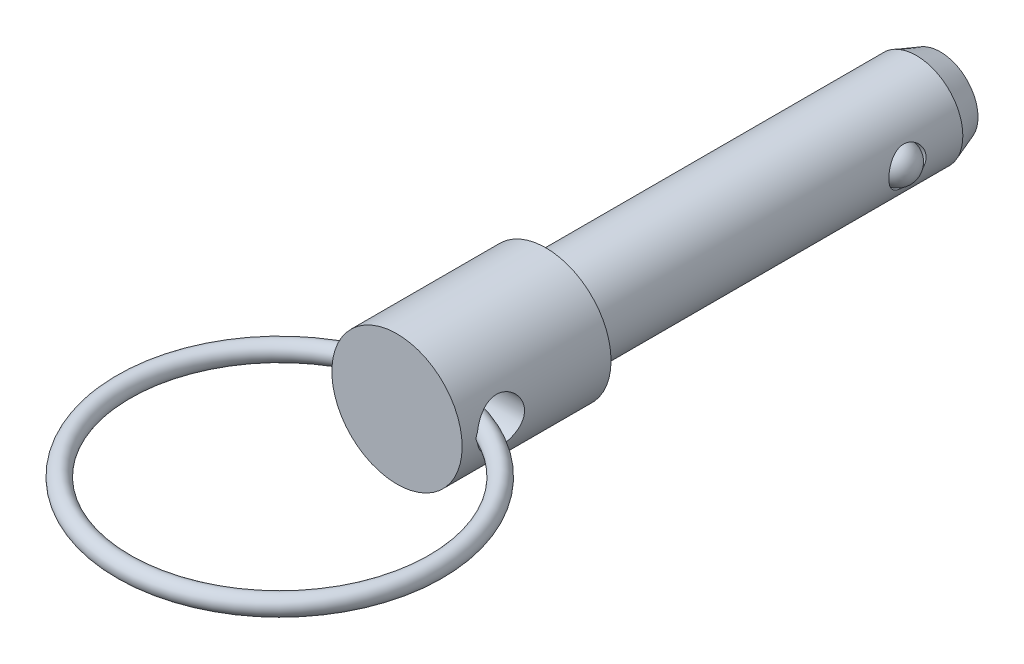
ISO-10303-21;
HEADER;
FILE_DESCRIPTION(('STEP AP214'),'2;1');
FILE_NAME('part.step','',(''),(''),'','','');
FILE_SCHEMA(('AUTOMOTIVE_DESIGN { 1 0 10303 214 1 1 1 1 }'));
ENDSEC;
DATA;
#1=APPLICATION_CONTEXT('core data for automotive mechanical design processes');
#2=APPLICATION_PROTOCOL_DEFINITION('international standard','automotive_design',2000,#1);
#3=PRODUCT_CONTEXT('',#1,'mechanical');
#4=PRODUCT('Part','Part','',(#3));
#5=PRODUCT_RELATED_PRODUCT_CATEGORY('part','',(#4));
#6=PRODUCT_DEFINITION_FORMATION('','',#4);
#7=PRODUCT_DEFINITION_CONTEXT('part definition',#1,'design');
#8=PRODUCT_DEFINITION('design','',#6,#7);
#9=PRODUCT_DEFINITION_SHAPE('','',#8);
#10=(LENGTH_UNIT() NAMED_UNIT(*) SI_UNIT(.MILLI.,.METRE.));
#11=(NAMED_UNIT(*) PLANE_ANGLE_UNIT() SI_UNIT($,.RADIAN.));
#12=(NAMED_UNIT(*) SI_UNIT($,.STERADIAN.) SOLID_ANGLE_UNIT());
#13=UNCERTAINTY_MEASURE_WITH_UNIT(LENGTH_MEASURE(1.E-05),#10,'distance_accuracy_value','');
#14=(GEOMETRIC_REPRESENTATION_CONTEXT(3) GLOBAL_UNCERTAINTY_ASSIGNED_CONTEXT((#13)) GLOBAL_UNIT_ASSIGNED_CONTEXT((#10,
#11,#12)) REPRESENTATION_CONTEXT('',''));
#15=CARTESIAN_POINT('',(0.,0.,0.));
#16=DIRECTION('',(0.,0.,1.));
#17=DIRECTION('',(1.,0.,0.));
#18=AXIS2_PLACEMENT_3D('',#15,#16,#17);
#19=CARTESIAN_POINT('',(7.9375,0.,9.398));
#20=DIRECTION('',(-1.,0.,0.));
#21=DIRECTION('',(0.,0.,-1.));
#22=AXIS2_PLACEMENT_3D('',#19,#20,#21);
#23=CYLINDRICAL_SURFACE('',#22,2.0193);
#24=CARTESIAN_POINT('',(-5.55645,0.413388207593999,11.3745329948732));
#25=CARTESIAN_POINT('',(-5.53323669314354,0.388835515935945,11.3796705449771));
#26=CARTESIAN_POINT('',(-5.51157389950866,0.362641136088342,11.3846690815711));
#27=CARTESIAN_POINT('',(-5.47216390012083,0.307044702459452,11.3940198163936));
#28=CARTESIAN_POINT('',(-5.45444977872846,0.277618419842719,11.3983664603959));
#29=CARTESIAN_POINT('',(-5.42406600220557,0.215851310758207,11.4059720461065));
#30=CARTESIAN_POINT('',(-5.41142802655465,0.183493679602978,11.4092241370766));
#31=CARTESIAN_POINT('',(-5.39235124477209,0.116986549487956,11.4141821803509));
#32=CARTESIAN_POINT('',(-5.38588919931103,0.0828442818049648,11.4158939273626));
#33=CARTESIAN_POINT('',(-5.37995615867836,0.0172985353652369,11.4174656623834));
#34=CARTESIAN_POINT('',(-5.37986165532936,-0.0140451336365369,11.4174908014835));
#35=CARTESIAN_POINT('',(-5.38511249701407,-0.0762532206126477,11.4160995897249));
#36=CARTESIAN_POINT('',(-5.39046041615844,-0.107117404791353,11.4146825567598));
#37=CARTESIAN_POINT('',(-5.40574321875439,-0.165640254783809,11.4106965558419));
#38=CARTESIAN_POINT('',(-5.41539031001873,-0.193380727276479,11.408200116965));
#39=CARTESIAN_POINT('',(-5.43862859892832,-0.247073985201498,11.4023097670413));
#40=CARTESIAN_POINT('',(-5.45222392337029,-0.273024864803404,11.398914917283));
#41=CARTESIAN_POINT('',(-5.48024922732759,-0.318737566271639,11.3920973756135));
#42=CARTESIAN_POINT('',(-5.4941872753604,-0.338820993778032,11.3887682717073));
#43=CARTESIAN_POINT('',(-5.523970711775,-0.37733037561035,11.3818282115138));
#44=CARTESIAN_POINT('',(-5.5398075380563,-0.395763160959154,11.378218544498));
#45=CARTESIAN_POINT('',(-5.55645,-0.413388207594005,11.3745329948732));
#46=B_SPLINE_CURVE_WITH_KNOTS('',3,(#24,#25,#26,#27,#28,#29,#30,#31,#32,#33,#34,#35,#36,#37,#38,
#39,#40,#41,#42,#43,#44,#45),.UNSPECIFIED.,.F.,.F.,(4,2,2,2,2,2,2,2,2,2,4),(0.,
0.102621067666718,0.206072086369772,0.310159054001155,0.413852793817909,0.507376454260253,
0.600944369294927,0.689017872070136,0.777183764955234,0.851068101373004,0.924630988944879),.UNSPECIFIED.);
#47=CARTESIAN_POINT('',(-5.54200209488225,0.397651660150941,11.3777589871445));
#48=VERTEX_POINT('',#47);
#49=CARTESIAN_POINT('',(-5.54200209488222,-0.397651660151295,11.3777589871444));
#50=VERTEX_POINT('',#49);
#51=EDGE_CURVE('E40',#48,#50,#46,.T.);
#52=ORIENTED_EDGE('',*,*,#51,.F.);
#53=CARTESIAN_POINT('',(-5.55625,0.,11.4173));
#54=CARTESIAN_POINT('',(-5.55624527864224,-0.109432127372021,11.4172937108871));
#55=CARTESIAN_POINT('',(-5.55298237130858,-0.218969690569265,11.408361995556));
#56=CARTESIAN_POINT('',(-5.54026368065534,-0.43490217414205,11.372953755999));
#57=CARTESIAN_POINT('',(-5.53079819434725,-0.541291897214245,11.3464497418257));
#58=CARTESIAN_POINT('',(-5.50670156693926,-0.747605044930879,11.2769560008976));
#59=CARTESIAN_POINT('',(-5.49208344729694,-0.84754402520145,11.2340078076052));
#60=CARTESIAN_POINT('',(-5.45915039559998,-1.03875753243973,11.1330083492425));
#61=CARTESIAN_POINT('',(-5.44083572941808,-1.13003268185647,11.0749581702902));
#62=CARTESIAN_POINT('',(-5.4015811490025,-1.30505728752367,10.9429422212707));
#63=CARTESIAN_POINT('',(-5.38056990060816,-1.38841141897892,10.8684736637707));
#64=CARTESIAN_POINT('',(-5.33865236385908,-1.54176439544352,10.7067995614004));
#65=CARTESIAN_POINT('',(-5.31774611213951,-1.61175885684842,10.6195898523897));
#66=CARTESIAN_POINT('',(-5.27759352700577,-1.73882919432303,10.4311528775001));
#67=CARTESIAN_POINT('',(-5.25843183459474,-1.79536185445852,10.3295394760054));
#68=CARTESIAN_POINT('',(-5.22503611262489,-1.89036141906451,10.1174402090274));
#69=CARTESIAN_POINT('',(-5.21080023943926,-1.92883508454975,10.0069576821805));
#70=CARTESIAN_POINT('',(-5.18962447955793,-1.98509166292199,9.78477737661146));
#71=CARTESIAN_POINT('',(-5.18242178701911,-2.00362275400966,9.67329490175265));
#72=CARTESIAN_POINT('',(-5.17535625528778,-2.02180769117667,9.44858805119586));
#73=CARTESIAN_POINT('',(-5.17549061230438,-2.02146874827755,9.33536435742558));
#74=CARTESIAN_POINT('',(-5.18285629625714,-2.00249790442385,9.11709454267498));
#75=CARTESIAN_POINT('',(-5.18969215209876,-1.98488533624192,9.01194405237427));
#76=CARTESIAN_POINT('',(-5.20903632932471,-1.93354575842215,8.80620743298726));
#77=CARTESIAN_POINT('',(-5.22154547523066,-1.89981640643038,8.70562196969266));
#78=CARTESIAN_POINT('',(-5.25107746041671,-1.81661001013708,8.50972358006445));
#79=CARTESIAN_POINT('',(-5.26817827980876,-1.76685762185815,8.41453987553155));
#80=CARTESIAN_POINT('',(-5.30493780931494,-1.65321144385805,8.23357336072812));
#81=CARTESIAN_POINT('',(-5.32459724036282,-1.58931366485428,8.14779321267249));
#82=CARTESIAN_POINT('',(-5.36576425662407,-1.44447059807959,7.98240722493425));
#83=CARTESIAN_POINT('',(-5.3873104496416,-1.36270785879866,7.90352531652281));
#84=CARTESIAN_POINT('',(-5.42876622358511,-1.18682967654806,7.76035905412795));
#85=CARTESIAN_POINT('',(-5.44867505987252,-1.09270866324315,7.69608131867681));
#86=CARTESIAN_POINT('',(-5.48497084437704,-0.893001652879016,7.58320896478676));
#87=CARTESIAN_POINT('',(-5.50130295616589,-0.787270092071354,7.53485348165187));
#88=CARTESIAN_POINT('',(-5.52817729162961,-0.568540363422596,7.45692936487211));
#89=CARTESIAN_POINT('',(-5.53873126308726,-0.455557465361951,7.42732259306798));
#90=CARTESIAN_POINT('',(-5.54924569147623,-0.284581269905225,7.39803699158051));
#91=CARTESIAN_POINT('',(-5.5518636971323,-0.227949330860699,7.39079572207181));
#92=CARTESIAN_POINT('',(-5.55536708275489,-0.114221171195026,7.38112558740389));
#93=CARTESIAN_POINT('',(-5.55625246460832,-0.0571249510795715,7.37869671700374));
#94=CARTESIAN_POINT('',(-5.55624527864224,0.109432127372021,7.37870628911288));
#95=CARTESIAN_POINT('',(-5.55298237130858,0.218969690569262,7.38763800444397));
#96=CARTESIAN_POINT('',(-5.54026368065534,0.434902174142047,7.42304624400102));
#97=CARTESIAN_POINT('',(-5.53079819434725,0.541291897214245,7.44955025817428));
#98=CARTESIAN_POINT('',(-5.50670156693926,0.74760504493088,7.51904399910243));
#99=CARTESIAN_POINT('',(-5.49208344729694,0.847544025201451,7.56199219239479));
#100=CARTESIAN_POINT('',(-5.45915039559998,1.03875753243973,7.66299165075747));
#101=CARTESIAN_POINT('',(-5.44083572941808,1.13003268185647,7.72104182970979));
#102=CARTESIAN_POINT('',(-5.4015811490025,1.30505728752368,7.85305777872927));
#103=CARTESIAN_POINT('',(-5.38056990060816,1.38841141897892,7.92752633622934));
#104=CARTESIAN_POINT('',(-5.33865236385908,1.54176439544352,8.08920043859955));
#105=CARTESIAN_POINT('',(-5.31774611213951,1.61175885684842,8.17641014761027));
#106=CARTESIAN_POINT('',(-5.27759352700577,1.73882919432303,8.36484712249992));
#107=CARTESIAN_POINT('',(-5.25843183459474,1.79536185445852,8.4664605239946));
#108=CARTESIAN_POINT('',(-5.22503611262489,1.89036141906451,8.6785597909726));
#109=CARTESIAN_POINT('',(-5.21080023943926,1.92883508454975,8.7890423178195));
#110=CARTESIAN_POINT('',(-5.18962447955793,1.985091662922,9.01122262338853));
#111=CARTESIAN_POINT('',(-5.18242178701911,2.00362275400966,9.12270509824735));
#112=CARTESIAN_POINT('',(-5.17535625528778,2.02180769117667,9.34741194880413));
#113=CARTESIAN_POINT('',(-5.17549061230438,2.02146874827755,9.46063564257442));
#114=CARTESIAN_POINT('',(-5.18285629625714,2.00249790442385,9.67890545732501));
#115=CARTESIAN_POINT('',(-5.18969215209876,1.98488533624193,9.78405594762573));
#116=CARTESIAN_POINT('',(-5.20903632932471,1.93354575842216,9.98979256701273));
#117=CARTESIAN_POINT('',(-5.22154547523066,1.89981640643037,10.0903780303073));
#118=CARTESIAN_POINT('',(-5.25107746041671,1.81661001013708,10.2862764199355));
#119=CARTESIAN_POINT('',(-5.26817827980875,1.76685762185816,10.3814601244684));
#120=CARTESIAN_POINT('',(-5.30493780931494,1.65321144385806,10.5624266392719));
#121=CARTESIAN_POINT('',(-5.32459724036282,1.58931366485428,10.6482067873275));
#122=CARTESIAN_POINT('',(-5.36576425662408,1.44447059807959,10.8135927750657));
#123=CARTESIAN_POINT('',(-5.3873104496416,1.36270785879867,10.8924746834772));
#124=CARTESIAN_POINT('',(-5.42876622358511,1.18682967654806,11.0356409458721));
#125=CARTESIAN_POINT('',(-5.44867505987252,1.09270866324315,11.0999186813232));
#126=CARTESIAN_POINT('',(-5.48497084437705,0.893001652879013,11.2127910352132));
#127=CARTESIAN_POINT('',(-5.5013029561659,0.787270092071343,11.2611465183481));
#128=CARTESIAN_POINT('',(-5.52817729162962,0.568540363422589,11.3390706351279));
#129=CARTESIAN_POINT('',(-5.53873126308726,0.455557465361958,11.3686774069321));
#130=CARTESIAN_POINT('',(-5.54924569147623,0.28458126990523,11.3979630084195));
#131=CARTESIAN_POINT('',(-5.5518636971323,0.2279493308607,11.4052042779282));
#132=CARTESIAN_POINT('',(-5.55536708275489,0.114221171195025,11.4148744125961));
#133=CARTESIAN_POINT('',(-5.55625246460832,0.0571249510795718,11.4173032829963));
#134=CARTESIAN_POINT('',(-5.55625,0.,11.4173));
#135=B_SPLINE_CURVE_WITH_KNOTS('',3,(#53,#54,#55,#56,#57,#58,#59,#60,#61,#62,#63,#64,#65,#66,
#67,#68,#69,#70,#71,#72,#73,#74,#75,#76,#77,#78,#79,#80,#81,#82,#83,#84,#85,#86,#87,#88,#89,#90,
#91,#92,#93,#94,#95,#96,#97,#98,#99,#100,#101,#102,#103,#104,#105,#106,#107,#108,#109,#110,#111,
#112,#113,#114,#115,#116,#117,#118,#119,#120,#121,#122,#123,#124,#125,#126,#127,#128,#129,#130,
#131,#132,#133,#134),.UNSPECIFIED.,.T.,.F.,(4,2,2,2,2,2,2,2,2,2,2,2,2,2,2,2,2,2,2,2,2,2,2,2,2,2,
2,2,2,2,2,2,2,2,2,2,2,2,2,2,4),(0.,0.328075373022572,0.65666519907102,0.984430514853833,
1.31217226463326,1.65185430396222,1.99164760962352,2.34343505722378,2.69509069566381,
3.03303658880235,3.37085333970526,3.68986542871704,4.00892389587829,4.33378721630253,
4.65874227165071,5.00406386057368,5.34954163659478,5.6999936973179,6.04973056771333,
6.22099023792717,6.39224972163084,6.72032509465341,7.04891492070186,7.37668023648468,
7.70442198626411,8.04410402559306,8.38389733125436,8.73568477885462,9.08734041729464,
9.42528631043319,9.7631030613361,10.0821151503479,10.4011736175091,10.7260369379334,
11.0509919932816,11.3963135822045,11.7417913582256,12.0922434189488,12.4419802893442,
12.613239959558,12.7844994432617),.UNSPECIFIED.);
#136=EDGE_CURVE('E66',#50,#48,#135,.T.);
#137=ORIENTED_EDGE('',*,*,#136,.F.);
#138=EDGE_LOOP('',(#52,#137));
#139=FACE_BOUND('',#138,.T.);
#140=CARTESIAN_POINT('',(5.55645,-0.413388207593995,11.3745329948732));
#141=CARTESIAN_POINT('',(5.53323669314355,-0.388835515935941,11.3796705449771));
#142=CARTESIAN_POINT('',(5.51157389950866,-0.362641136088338,11.3846690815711));
#143=CARTESIAN_POINT('',(5.47216390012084,-0.307044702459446,11.3940198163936));
#144=CARTESIAN_POINT('',(5.45444977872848,-0.277618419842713,11.3983664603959));
#145=CARTESIAN_POINT('',(5.42406600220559,-0.215851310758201,11.4059720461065));
#146=CARTESIAN_POINT('',(5.41142802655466,-0.183493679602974,11.4092241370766));
#147=CARTESIAN_POINT('',(5.3923512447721,-0.116986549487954,11.4141821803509));
#148=CARTESIAN_POINT('',(5.38588919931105,-0.0828442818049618,11.4158939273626));
#149=CARTESIAN_POINT('',(5.37995615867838,-0.0172985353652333,11.4174656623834));
#150=CARTESIAN_POINT('',(5.37986165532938,0.0140451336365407,11.4174908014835));
#151=CARTESIAN_POINT('',(5.38511249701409,0.0762532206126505,11.4160995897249));
#152=CARTESIAN_POINT('',(5.39046041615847,0.107117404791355,11.4146825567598));
#153=CARTESIAN_POINT('',(5.40574321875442,0.165640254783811,11.4106965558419));
#154=CARTESIAN_POINT('',(5.41539031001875,0.193380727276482,11.408200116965));
#155=CARTESIAN_POINT('',(5.43862859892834,0.247073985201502,11.4023097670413));
#156=CARTESIAN_POINT('',(5.45222392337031,0.273024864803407,11.398914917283));
#157=CARTESIAN_POINT('',(5.48024922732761,0.318737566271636,11.3920973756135));
#158=CARTESIAN_POINT('',(5.49418727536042,0.338820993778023,11.3887682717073));
#159=CARTESIAN_POINT('',(5.52397071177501,0.377330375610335,11.3818282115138));
#160=CARTESIAN_POINT('',(5.5398075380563,0.395763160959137,11.378218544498));
#161=CARTESIAN_POINT('',(5.55645,0.413388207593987,11.3745329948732));
#162=B_SPLINE_CURVE_WITH_KNOTS('',3,(#140,#141,#142,#143,#144,#145,#146,#147,#148,#149,#150,
#151,#152,#153,#154,#155,#156,#157,#158,#159,#160,#161),.UNSPECIFIED.,.F.,.F.,(4,2,2,2,2,2,2,2,
2,2,4),(0.,0.10262106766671,0.206072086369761,0.310159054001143,0.413852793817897,
0.507376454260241,0.600944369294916,0.689017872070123,0.777183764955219,0.851068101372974,
0.924630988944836),.UNSPECIFIED.);
#163=CARTESIAN_POINT('',(5.54200209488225,-0.397651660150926,11.3777589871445));
#164=VERTEX_POINT('',#163);
#165=CARTESIAN_POINT('',(5.54200209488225,0.397651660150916,11.3777589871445));
#166=VERTEX_POINT('',#165);
#167=EDGE_CURVE('E33',#164,#166,#162,.T.);
#168=ORIENTED_EDGE('',*,*,#167,.F.);
#169=CARTESIAN_POINT('',(5.55625,0.,7.3787));
#170=CARTESIAN_POINT('',(5.55624527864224,-0.109432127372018,7.37870628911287));
#171=CARTESIAN_POINT('',(5.55298237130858,-0.21896969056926,7.38763800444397));
#172=CARTESIAN_POINT('',(5.54026368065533,-0.434902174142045,7.42304624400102));
#173=CARTESIAN_POINT('',(5.53079819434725,-0.541291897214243,7.44955025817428));
#174=CARTESIAN_POINT('',(5.50670156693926,-0.747605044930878,7.51904399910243));
#175=CARTESIAN_POINT('',(5.49208344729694,-0.847544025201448,7.56199219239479));
#176=CARTESIAN_POINT('',(5.45915039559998,-1.03875753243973,7.66299165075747));
#177=CARTESIAN_POINT('',(5.44083572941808,-1.13003268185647,7.72104182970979));
#178=CARTESIAN_POINT('',(5.4015811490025,-1.30505728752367,7.85305777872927));
#179=CARTESIAN_POINT('',(5.38056990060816,-1.38841141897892,7.92752633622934));
#180=CARTESIAN_POINT('',(5.33865236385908,-1.54176439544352,8.08920043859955));
#181=CARTESIAN_POINT('',(5.31774611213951,-1.61175885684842,8.17641014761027));
#182=CARTESIAN_POINT('',(5.27759352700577,-1.73882919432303,8.36484712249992));
#183=CARTESIAN_POINT('',(5.25843183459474,-1.79536185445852,8.4664605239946));
#184=CARTESIAN_POINT('',(5.22503611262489,-1.89036141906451,8.6785597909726));
#185=CARTESIAN_POINT('',(5.21080023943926,-1.92883508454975,8.7890423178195));
#186=CARTESIAN_POINT('',(5.18962447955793,-1.98509166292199,9.01122262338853));
#187=CARTESIAN_POINT('',(5.18242178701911,-2.00362275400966,9.12270509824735));
#188=CARTESIAN_POINT('',(5.17535625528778,-2.02180769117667,9.34741194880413));
#189=CARTESIAN_POINT('',(5.17549061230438,-2.02146874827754,9.46063564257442));
#190=CARTESIAN_POINT('',(5.18285629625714,-2.00249790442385,9.67890545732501));
#191=CARTESIAN_POINT('',(5.18969215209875,-1.98488533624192,9.78405594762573));
#192=CARTESIAN_POINT('',(5.20903632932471,-1.93354575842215,9.98979256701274));
#193=CARTESIAN_POINT('',(5.22154547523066,-1.89981640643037,10.0903780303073));
#194=CARTESIAN_POINT('',(5.25107746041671,-1.81661001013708,10.2862764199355));
#195=CARTESIAN_POINT('',(5.26817827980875,-1.76685762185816,10.3814601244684));
#196=CARTESIAN_POINT('',(5.30493780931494,-1.65321144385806,10.5624266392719));
#197=CARTESIAN_POINT('',(5.32459724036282,-1.58931366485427,10.6482067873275));
#198=CARTESIAN_POINT('',(5.36576425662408,-1.44447059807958,10.8135927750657));
#199=CARTESIAN_POINT('',(5.3873104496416,-1.36270785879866,10.8924746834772));
#200=CARTESIAN_POINT('',(5.42876622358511,-1.18682967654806,11.0356409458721));
#201=CARTESIAN_POINT('',(5.44867505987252,-1.09270866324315,11.0999186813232));
#202=CARTESIAN_POINT('',(5.48497084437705,-0.893001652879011,11.2127910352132));
#203=CARTESIAN_POINT('',(5.50130295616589,-0.78727009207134,11.2611465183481));
#204=CARTESIAN_POINT('',(5.52817729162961,-0.568540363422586,11.3390706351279));
#205=CARTESIAN_POINT('',(5.53873126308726,-0.455557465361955,11.3686774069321));
#206=CARTESIAN_POINT('',(5.54924569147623,-0.284581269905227,11.3979630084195));
#207=CARTESIAN_POINT('',(5.5518636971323,-0.227949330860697,11.4052042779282));
#208=CARTESIAN_POINT('',(5.55536708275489,-0.114221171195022,11.4148744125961));
#209=CARTESIAN_POINT('',(5.55625246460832,-0.0571249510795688,11.4173032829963));
#210=CARTESIAN_POINT('',(5.55624527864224,0.109432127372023,11.4172937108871));
#211=CARTESIAN_POINT('',(5.55298237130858,0.218969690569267,11.408361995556));
#212=CARTESIAN_POINT('',(5.54026368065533,0.434902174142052,11.372953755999));
#213=CARTESIAN_POINT('',(5.53079819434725,0.541291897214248,11.3464497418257));
#214=CARTESIAN_POINT('',(5.50670156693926,0.747605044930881,11.2769560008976));
#215=CARTESIAN_POINT('',(5.49208344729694,0.847544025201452,11.2340078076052));
#216=CARTESIAN_POINT('',(5.45915039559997,1.03875753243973,11.1330083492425));
#217=CARTESIAN_POINT('',(5.44083572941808,1.13003268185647,11.0749581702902));
#218=CARTESIAN_POINT('',(5.4015811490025,1.30505728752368,10.9429422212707));
#219=CARTESIAN_POINT('',(5.38056990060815,1.38841141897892,10.8684736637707));
#220=CARTESIAN_POINT('',(5.33865236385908,1.54176439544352,10.7067995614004));
#221=CARTESIAN_POINT('',(5.31774611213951,1.61175885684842,10.6195898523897));
#222=CARTESIAN_POINT('',(5.27759352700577,1.73882919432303,10.4311528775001));
#223=CARTESIAN_POINT('',(5.25843183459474,1.79536185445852,10.3295394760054));
#224=CARTESIAN_POINT('',(5.22503611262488,1.89036141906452,10.1174402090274));
#225=CARTESIAN_POINT('',(5.21080023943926,1.92883508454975,10.0069576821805));
#226=CARTESIAN_POINT('',(5.18962447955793,1.985091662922,9.78477737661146));
#227=CARTESIAN_POINT('',(5.18242178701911,2.00362275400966,9.67329490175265));
#228=CARTESIAN_POINT('',(5.17535625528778,2.02180769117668,9.44858805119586));
#229=CARTESIAN_POINT('',(5.17549061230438,2.02146874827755,9.33536435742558));
#230=CARTESIAN_POINT('',(5.18285629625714,2.00249790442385,9.11709454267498));
#231=CARTESIAN_POINT('',(5.18969215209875,1.98488533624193,9.01194405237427));
#232=CARTESIAN_POINT('',(5.20903632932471,1.93354575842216,8.80620743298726));
#233=CARTESIAN_POINT('',(5.22154547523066,1.89981640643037,8.70562196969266));
#234=CARTESIAN_POINT('',(5.25107746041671,1.81661001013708,8.50972358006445));
#235=CARTESIAN_POINT('',(5.26817827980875,1.76685762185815,8.41453987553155));
#236=CARTESIAN_POINT('',(5.30493780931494,1.65321144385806,8.23357336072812));
#237=CARTESIAN_POINT('',(5.32459724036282,1.58931366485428,8.14779321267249));
#238=CARTESIAN_POINT('',(5.36576425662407,1.44447059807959,7.98240722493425));
#239=CARTESIAN_POINT('',(5.3873104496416,1.36270785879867,7.90352531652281));
#240=CARTESIAN_POINT('',(5.42876622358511,1.18682967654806,7.76035905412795));
#241=CARTESIAN_POINT('',(5.44867505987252,1.09270866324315,7.69608131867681));
#242=CARTESIAN_POINT('',(5.48497084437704,0.893001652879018,7.58320896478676));
#243=CARTESIAN_POINT('',(5.50130295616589,0.787270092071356,7.53485348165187));
#244=CARTESIAN_POINT('',(5.52817729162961,0.568540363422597,7.45692936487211));
#245=CARTESIAN_POINT('',(5.53873126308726,0.455557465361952,7.42732259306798));
#246=CARTESIAN_POINT('',(5.54924569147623,0.284581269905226,7.39803699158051));
#247=CARTESIAN_POINT('',(5.5518636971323,0.2279493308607,7.39079572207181));
#248=CARTESIAN_POINT('',(5.55536708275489,0.114221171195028,7.38112558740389));
#249=CARTESIAN_POINT('',(5.55625246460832,0.0571249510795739,7.37869671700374));
#250=CARTESIAN_POINT('',(5.55625,0.,7.3787));
#251=B_SPLINE_CURVE_WITH_KNOTS('',3,(#169,#170,#171,#172,#173,#174,#175,#176,#177,#178,#179,
#180,#181,#182,#183,#184,#185,#186,#187,#188,#189,#190,#191,#192,#193,#194,#195,#196,#197,#198,
#199,#200,#201,#202,#203,#204,#205,#206,#207,#208,#209,#210,#211,#212,#213,#214,#215,#216,#217,
#218,#219,#220,#221,#222,#223,#224,#225,#226,#227,#228,#229,#230,#231,#232,#233,#234,#235,#236,
#237,#238,#239,#240,#241,#242,#243,#244,#245,#246,#247,#248,#249,#250),.UNSPECIFIED.,.T.,.F.,(4,
2,2,2,2,2,2,2,2,2,2,2,2,2,2,2,2,2,2,2,2,2,2,2,2,2,2,2,2,2,2,2,2,2,2,2,2,2,2,2,4),(0.,
0.328075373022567,0.656665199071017,0.984430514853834,1.31217226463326,1.65185430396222,
1.99164760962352,2.34343505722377,2.6950906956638,3.03303658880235,3.37085333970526,
3.68986542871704,4.00892389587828,4.33378721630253,4.65874227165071,5.00406386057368,
5.34954163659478,5.69999369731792,6.04973056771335,6.22099023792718,6.39224972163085,
6.72032509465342,7.04891492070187,7.37668023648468,7.70442198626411,8.04410402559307,
8.38389733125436,8.73568477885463,9.08734041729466,9.4252863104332,9.76310306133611,
10.0821151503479,10.4011736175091,10.7260369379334,11.0509919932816,11.3963135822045,
11.7417913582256,12.0922434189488,12.4419802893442,12.613239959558,12.7844994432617),.UNSPECIFIED.);
#252=EDGE_CURVE('E62',#166,#164,#251,.T.);
#253=ORIENTED_EDGE('',*,*,#252,.F.);
#254=EDGE_LOOP('',(#168,#253));
#255=FACE_BOUND('',#254,.T.);
#256=ADVANCED_FACE('F14',(#139,#255),#23,.F.);
#257=CARTESIAN_POINT('',(0.,0.,-28.63596));
#258=DIRECTION('',(0.,0.,-1.));
#259=DIRECTION('',(1.,0.,0.));
#260=AXIS2_PLACEMENT_3D('',#257,#258,#259);
#261=CYLINDRICAL_SURFACE('',#260,5.55625);
#262=ORIENTED_EDGE('',*,*,#252,.T.);
#263=CARTESIAN_POINT('',(5.55009347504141,-0.261488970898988,9.78608403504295));
#264=CARTESIAN_POINT('',(5.54812529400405,-0.303251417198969,9.80096224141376));
#265=CARTESIAN_POINT('',(5.5457404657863,-0.343758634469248,9.81942005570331));
#266=CARTESIAN_POINT('',(5.54040847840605,-0.421066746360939,9.86292845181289));
#267=CARTESIAN_POINT('',(5.5374605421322,-0.45786241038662,9.88798816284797));
#268=CARTESIAN_POINT('',(5.53134134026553,-0.526658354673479,9.94386457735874));
#269=CARTESIAN_POINT('',(5.52817046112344,-0.558666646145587,9.97467146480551));
#270=CARTESIAN_POINT('',(5.52194469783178,-0.617178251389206,10.0411137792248));
#271=CARTESIAN_POINT('',(5.51888978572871,-0.643682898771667,10.0767480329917));
#272=CARTESIAN_POINT('',(5.51313628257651,-0.691254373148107,10.1527268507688));
#273=CARTESIAN_POINT('',(5.51044827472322,-0.712171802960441,10.1931655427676));
#274=CARTESIAN_POINT('',(5.50578097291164,-0.747399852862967,10.2768577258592));
#275=CARTESIAN_POINT('',(5.50380188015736,-0.761708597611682,10.3201120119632));
#276=CARTESIAN_POINT('',(5.50062483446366,-0.784334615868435,10.4110491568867));
#277=CARTESIAN_POINT('',(5.4994831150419,-0.792223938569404,10.4588401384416));
#278=CARTESIAN_POINT('',(5.49826873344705,-0.800607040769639,10.5550754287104));
#279=CARTESIAN_POINT('',(5.49819646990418,-0.801098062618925,10.6035199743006));
#280=CARTESIAN_POINT('',(5.49912806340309,-0.79468062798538,10.7039443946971));
#281=CARTESIAN_POINT('',(5.50022168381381,-0.787154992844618,10.7558841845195));
#282=CARTESIAN_POINT('',(5.50347103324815,-0.764103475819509,10.8579332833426));
#283=CARTESIAN_POINT('',(5.5056272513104,-0.748573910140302,10.9080417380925));
#284=CARTESIAN_POINT('',(5.51091051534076,-0.708667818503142,11.0082212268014));
#285=CARTESIAN_POINT('',(5.51408971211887,-0.683800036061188,11.0580951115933));
#286=CARTESIAN_POINT('',(5.5209680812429,-0.625839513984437,11.1528267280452));
#287=CARTESIAN_POINT('',(5.52466742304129,-0.59274409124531,11.197682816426));
#288=CARTESIAN_POINT('',(5.53199718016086,-0.519831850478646,11.2794067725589));
#289=CARTESIAN_POINT('',(5.53562669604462,-0.480224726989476,11.3164602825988));
#290=CARTESIAN_POINT('',(5.54239660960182,-0.39445002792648,11.3820559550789));
#291=CARTESIAN_POINT('',(5.54553772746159,-0.348292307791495,11.4106107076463));
#292=CARTESIAN_POINT('',(5.55042537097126,-0.257766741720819,11.4537693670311));
#293=CARTESIAN_POINT('',(5.55230678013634,-0.214079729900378,11.4697807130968));
#294=CARTESIAN_POINT('',(5.55503790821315,-0.124373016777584,11.4927832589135));
#295=CARTESIAN_POINT('',(5.55588906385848,-0.0783566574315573,11.4997870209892));
#296=CARTESIAN_POINT('',(5.55638432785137,0.0070585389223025,11.5038718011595));
#297=CARTESIAN_POINT('',(5.55619261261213,0.0463971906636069,11.5023023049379));
#298=CARTESIAN_POINT('',(5.55499790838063,0.124194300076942,11.4923961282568));
#299=CARTESIAN_POINT('',(5.55399500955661,0.162652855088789,11.484060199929));
#300=CARTESIAN_POINT('',(5.55133569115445,0.236455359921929,11.4614747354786));
#301=CARTESIAN_POINT('',(5.54970019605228,0.271858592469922,11.4474138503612));
#302=CARTESIAN_POINT('',(5.54593788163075,0.340082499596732,11.414086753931));
#303=CARTESIAN_POINT('',(5.54381093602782,0.372902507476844,11.394819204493));
#304=CARTESIAN_POINT('',(5.53902830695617,0.438479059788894,11.3497412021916));
#305=CARTESIAN_POINT('',(5.53634134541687,0.470920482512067,11.3234773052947));
#306=CARTESIAN_POINT('',(5.5308403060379,0.531649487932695,11.2665410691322));
#307=CARTESIAN_POINT('',(5.52802616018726,0.559934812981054,11.2358663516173));
#308=CARTESIAN_POINT('',(5.52207389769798,0.616058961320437,11.1660010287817));
#309=CARTESIAN_POINT('',(5.51895184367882,0.643171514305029,11.1262251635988));
#310=CARTESIAN_POINT('',(5.5131400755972,0.691221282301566,11.0430715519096));
#311=CARTESIAN_POINT('',(5.51045062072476,0.712154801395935,10.9996916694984));
#312=CARTESIAN_POINT('',(5.50546631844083,0.749774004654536,10.9047684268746));
#313=CARTESIAN_POINT('',(5.5032620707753,0.765608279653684,10.8528805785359));
#314=CARTESIAN_POINT('',(5.49999925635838,0.788707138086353,10.7471802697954));
#315=CARTESIAN_POINT('',(5.49894104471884,0.795969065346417,10.693367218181));
#316=CARTESIAN_POINT('',(5.49812737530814,0.801573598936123,10.5836973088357));
#317=CARTESIAN_POINT('',(5.49841008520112,0.799654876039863,10.5278260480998));
#318=CARTESIAN_POINT('',(5.50039129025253,0.785912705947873,10.4173293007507));
#319=CARTESIAN_POINT('',(5.50208922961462,0.774093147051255,10.3627033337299));
#320=CARTESIAN_POINT('',(5.50657222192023,0.741502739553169,10.2600057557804));
#321=CARTESIAN_POINT('',(5.50928213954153,0.72134199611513,10.2117380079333));
#322=CARTESIAN_POINT('',(5.51545799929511,0.672487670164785,10.1197820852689));
#323=CARTESIAN_POINT('',(5.51892350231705,0.643799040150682,10.0760912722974));
#324=CARTESIAN_POINT('',(5.52582601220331,0.581424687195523,9.99852087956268));
#325=CARTESIAN_POINT('',(5.52923968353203,0.548383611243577,9.96412004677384));
#326=CARTESIAN_POINT('',(5.53588272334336,0.476663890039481,9.90178589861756));
#327=CARTESIAN_POINT('',(5.53911216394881,0.437987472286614,9.87385003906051));
#328=CARTESIAN_POINT('',(5.54480401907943,0.35854502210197,9.82683552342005));
#329=CARTESIAN_POINT('',(5.54729992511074,0.318028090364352,9.80733901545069));
#330=CARTESIAN_POINT('',(5.55147034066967,0.234199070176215,9.7755782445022));
#331=CARTESIAN_POINT('',(5.55314476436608,0.190886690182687,9.76331473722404));
#332=CARTESIAN_POINT('',(5.55544526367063,0.103875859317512,9.74662090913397));
#333=CARTESIAN_POINT('',(5.55609634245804,0.0602137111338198,9.74200361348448));
#334=CARTESIAN_POINT('',(5.55635470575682,-0.0272293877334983,9.7401597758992));
#335=CARTESIAN_POINT('',(5.55596342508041,-0.0710100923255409,9.74292307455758));
#336=CARTESIAN_POINT('',(5.55456091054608,-0.139289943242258,9.75303365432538));
#337=CARTESIAN_POINT('',(5.55387840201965,-0.164176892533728,9.75797314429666));
#338=CARTESIAN_POINT('',(5.55220711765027,-0.213342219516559,9.77024669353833));
#339=CARTESIAN_POINT('',(5.55121834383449,-0.237620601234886,9.77758073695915));
#340=CARTESIAN_POINT('',(5.55009347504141,-0.261488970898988,9.78608403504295));
#341=B_SPLINE_CURVE_WITH_KNOTS('',3,(#263,#264,#265,#266,#267,#268,#269,#270,#271,#272,#273,
#274,#275,#276,#277,#278,#279,#280,#281,#282,#283,#284,#285,#286,#287,#288,#289,#290,#291,#292,
#293,#294,#295,#296,#297,#298,#299,#300,#301,#302,#303,#304,#305,#306,#307,#308,#309,#310,#311,
#312,#313,#314,#315,#316,#317,#318,#319,#320,#321,#322,#323,#324,#325,#326,#327,#328,#329,#330,
#331,#332,#333,#334,#335,#336,#337,#338,#339,#340),.UNSPECIFIED.,.T.,.F.,(4,2,2,2,2,2,2,2,2,2,2,
2,2,2,2,2,2,2,2,2,2,2,2,2,2,2,2,2,2,2,2,2,2,2,2,2,2,2,4),(0.,0.133035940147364,
0.266256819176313,0.399252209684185,0.532215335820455,0.668441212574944,0.804705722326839,
0.949444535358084,1.09423729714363,1.25104087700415,1.40791668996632,1.57457416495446,
1.74128605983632,1.9034167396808,2.06530602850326,2.20414603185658,2.34279219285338,
2.46030997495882,2.57781469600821,2.69172579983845,2.80566620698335,2.93066170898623,
3.05572486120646,3.19986521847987,3.34409161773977,3.50624490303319,3.66844841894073,
3.83529611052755,4.00207830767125,4.15836501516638,4.31456113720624,4.45728171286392,
4.59994602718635,4.73438372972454,4.86883547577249,4.99994808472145,5.13088030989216,
5.20691445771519,5.28294810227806),.UNSPECIFIED.);
#342=EDGE_CURVE('E27',#164,#166,#341,.T.);
#343=ORIENTED_EDGE('',*,*,#342,.T.);
#344=EDGE_LOOP('',(#262,#343));
#345=FACE_BOUND('',#344,.T.);
#346=CARTESIAN_POINT('',(0.,0.,-8.27046764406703E-11));
#347=DIRECTION('',(0.,0.,-1.));
#348=DIRECTION('',(1.,0.,0.));
#349=AXIS2_PLACEMENT_3D('',#346,#347,#348);
#350=CIRCLE('',#349,5.55625000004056);
#351=CARTESIAN_POINT('',(5.55625000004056,0.,-8.2704921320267E-11));
#352=VERTEX_POINT('',#351);
#353=EDGE_CURVE('E71',#352,#352,#350,.T.);
#354=ORIENTED_EDGE('',*,*,#353,.F.);
#355=EDGE_LOOP('',(#354));
#356=FACE_BOUND('',#355,.T.);
#357=CARTESIAN_POINT('',(0.,0.,12.7000000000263));
#358=DIRECTION('',(0.,0.,-1.));
#359=DIRECTION('',(1.,0.,0.));
#360=AXIS2_PLACEMENT_3D('',#357,#358,#359);
#361=CIRCLE('',#360,5.55625000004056);
#362=CARTESIAN_POINT('',(5.55625000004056,0.,12.7000000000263));
#363=VERTEX_POINT('',#362);
#364=EDGE_CURVE('E279',#363,#363,#361,.T.);
#365=ORIENTED_EDGE('',*,*,#364,.T.);
#366=EDGE_LOOP('',(#365));
#367=FACE_BOUND('',#366,.T.);
#368=ORIENTED_EDGE('',*,*,#136,.T.);
#369=CARTESIAN_POINT('',(-5.55009347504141,-0.261488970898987,9.78608403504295));
#370=CARTESIAN_POINT('',(-5.55201952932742,-0.220600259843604,9.77152029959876));
#371=CARTESIAN_POINT('',(-5.55354800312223,-0.17846445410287,9.76037150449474));
#372=CARTESIAN_POINT('',(-5.5556384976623,-0.0928868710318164,9.74524129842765));
#373=CARTESIAN_POINT('',(-5.55620009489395,-0.0494445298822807,9.7412630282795));
#374=CARTESIAN_POINT('',(-5.55629347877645,0.0374935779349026,9.74059719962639));
#375=CARTESIAN_POINT('',(-5.55582538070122,0.080989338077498,9.74390882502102));
#376=CARTESIAN_POINT('',(-5.55391173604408,0.16679574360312,9.75772411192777));
#377=CARTESIAN_POINT('',(-5.5524662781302,0.209106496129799,9.76822712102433));
#378=CARTESIAN_POINT('',(-5.54875885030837,0.291350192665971,9.79611251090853));
#379=CARTESIAN_POINT('',(-5.54649699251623,0.331283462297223,9.81349394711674));
#380=CARTESIAN_POINT('',(-5.54140563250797,0.407683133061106,9.8546186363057));
#381=CARTESIAN_POINT('',(-5.53857612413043,0.444149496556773,9.87836195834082));
#382=CARTESIAN_POINT('',(-5.53262152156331,0.513054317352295,9.93180289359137));
#383=CARTESIAN_POINT('',(-5.52949345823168,0.545442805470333,9.96156453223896));
#384=CARTESIAN_POINT('',(-5.52330278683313,0.60492731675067,10.0259730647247));
#385=CARTESIAN_POINT('',(-5.52024018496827,0.632022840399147,10.0606204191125));
#386=CARTESIAN_POINT('',(-5.51440051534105,0.681126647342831,10.1349305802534));
#387=CARTESIAN_POINT('',(-5.51163525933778,0.702950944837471,10.1747156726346));
#388=CARTESIAN_POINT('',(-5.50677513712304,0.740062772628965,10.2572565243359));
#389=CARTESIAN_POINT('',(-5.50468043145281,0.755348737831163,10.3000129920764));
#390=CARTESIAN_POINT('',(-5.50124315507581,0.780002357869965,10.3899815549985));
#391=CARTESIAN_POINT('',(-5.49995301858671,0.78896169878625,10.4373072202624));
#392=CARTESIAN_POINT('',(-5.498425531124,0.799536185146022,10.5327838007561));
#393=CARTESIAN_POINT('',(-5.49818856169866,0.80114866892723,10.580935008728));
#394=CARTESIAN_POINT('',(-5.49877665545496,0.797104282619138,10.6808979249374));
#395=CARTESIAN_POINT('',(-5.49969077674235,0.790837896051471,10.7326845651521));
#396=CARTESIAN_POINT('',(-5.502598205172,0.770345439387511,10.8346351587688));
#397=CARTESIAN_POINT('',(-5.50459199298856,0.756115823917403,10.8847983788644));
#398=CARTESIAN_POINT('',(-5.50958513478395,0.718862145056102,10.9855133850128));
#399=CARTESIAN_POINT('',(-5.51264228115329,0.695318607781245,11.0358713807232));
#400=CARTESIAN_POINT('',(-5.51933971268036,0.639982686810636,11.1318512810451));
#401=CARTESIAN_POINT('',(-5.5229802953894,0.608186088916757,11.177470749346));
#402=CARTESIAN_POINT('',(-5.53030695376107,0.537456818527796,11.2614236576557));
#403=CARTESIAN_POINT('',(-5.53399100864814,0.498663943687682,11.2998741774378));
#404=CARTESIAN_POINT('',(-5.54094301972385,0.414294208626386,11.3684444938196));
#405=CARTESIAN_POINT('',(-5.54421186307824,0.368732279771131,11.3985822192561));
#406=CARTESIAN_POINT('',(-5.54902610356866,0.285409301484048,11.4415518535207));
#407=CARTESIAN_POINT('',(-5.55079831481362,0.248931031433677,11.4568629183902));
#408=CARTESIAN_POINT('',(-5.55365405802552,0.173909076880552,11.4812007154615));
#409=CARTESIAN_POINT('',(-5.55473812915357,0.13536703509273,11.4902323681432));
#410=CARTESIAN_POINT('',(-5.55609389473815,0.0571634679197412,11.5014913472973));
#411=CARTESIAN_POINT('',(-5.55636320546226,0.0174989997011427,11.5036987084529));
#412=CARTESIAN_POINT('',(-5.55604928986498,-0.0615987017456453,11.5011080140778));
#413=CARTESIAN_POINT('',(-5.55546601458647,-0.10103192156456,11.4963095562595));
#414=CARTESIAN_POINT('',(-5.5535635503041,-0.176675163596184,11.4803936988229));
#415=CARTESIAN_POINT('',(-5.55227928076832,-0.212950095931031,11.4695756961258));
#416=CARTESIAN_POINT('',(-5.54913333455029,-0.283330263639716,11.4424161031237));
#417=CARTESIAN_POINT('',(-5.54727154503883,-0.317435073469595,11.4260734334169));
#418=CARTESIAN_POINT('',(-5.54300097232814,-0.385072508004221,11.3872975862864));
#419=CARTESIAN_POINT('',(-5.54056357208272,-0.418407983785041,11.3645254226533));
#420=CARTESIAN_POINT('',(-5.53544762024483,-0.481387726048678,11.3143838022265));
#421=CARTESIAN_POINT('',(-5.53276895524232,-0.511030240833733,11.2870121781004));
#422=CARTESIAN_POINT('',(-5.52699292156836,-0.570330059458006,11.2242365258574));
#423=CARTESIAN_POINT('',(-5.52389129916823,-0.599362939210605,11.1882432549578));
#424=CARTESIAN_POINT('',(-5.51794192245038,-0.651866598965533,11.1123875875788));
#425=CARTESIAN_POINT('',(-5.51509432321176,-0.675333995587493,11.0725228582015));
#426=CARTESIAN_POINT('',(-5.50953849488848,-0.719347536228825,10.9840543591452));
#427=CARTESIAN_POINT('',(-5.50690598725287,-0.739020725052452,10.9350095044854));
#428=CARTESIAN_POINT('',(-5.50259788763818,-0.770442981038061,10.8343900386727));
#429=CARTESIAN_POINT('',(-5.50092272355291,-0.782188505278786,10.7828143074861));
#430=CARTESIAN_POINT('',(-5.49868146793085,-0.797800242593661,10.6753545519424));
#431=CARTESIAN_POINT('',(-5.49818587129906,-0.801166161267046,10.6193948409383));
#432=CARTESIAN_POINT('',(-5.49862892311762,-0.798121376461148,10.5077343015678));
#433=CARTESIAN_POINT('',(-5.49956724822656,-0.791712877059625,10.452033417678));
#434=CARTESIAN_POINT('',(-5.50274081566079,-0.76933610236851,10.3451160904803));
#435=CARTESIAN_POINT('',(-5.50491833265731,-0.753792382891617,10.2938098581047));
#436=CARTESIAN_POINT('',(-5.51027934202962,-0.713544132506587,10.1949693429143));
#437=CARTESIAN_POINT('',(-5.51346234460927,-0.688844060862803,10.1474332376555));
#438=CARTESIAN_POINT('',(-5.520102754,-0.633315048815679,10.0619154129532));
#439=CARTESIAN_POINT('',(-5.52351228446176,-0.603205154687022,10.0234624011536));
#440=CARTESIAN_POINT('',(-5.53038590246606,-0.536527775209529,9.9526689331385));
#441=CARTESIAN_POINT('',(-5.53384993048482,-0.49996694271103,9.92032224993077));
#442=CARTESIAN_POINT('',(-5.53964550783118,-0.430319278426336,9.86936528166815));
#443=CARTESIAN_POINT('',(-5.54205683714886,-0.398291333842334,9.8493012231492));
#444=CARTESIAN_POINT('',(-5.54644342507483,-0.331652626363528,9.81399262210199));
#445=CARTESIAN_POINT('',(-5.54841874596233,-0.297042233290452,9.79874739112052));
#446=CARTESIAN_POINT('',(-5.55009347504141,-0.261488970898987,9.78608403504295));
#447=B_SPLINE_CURVE_WITH_KNOTS('',3,(#369,#370,#371,#372,#373,#374,#375,#376,#377,#378,#379,
#380,#381,#382,#383,#384,#385,#386,#387,#388,#389,#390,#391,#392,#393,#394,#395,#396,#397,#398,
#399,#400,#401,#402,#403,#404,#405,#406,#407,#408,#409,#410,#411,#412,#413,#414,#415,#416,#417,
#418,#419,#420,#421,#422,#423,#424,#425,#426,#427,#428,#429,#430,#431,#432,#433,#434,#435,#436,
#437,#438,#439,#440,#441,#442,#443,#444,#445,#446),.UNSPECIFIED.,.T.,.F.,(4,2,2,2,2,2,2,2,2,2,2,
2,2,2,2,2,2,2,2,2,2,2,2,2,2,2,2,2,2,2,2,2,2,2,2,2,2,2,4),(0.,0.130208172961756,
0.260473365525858,0.39072397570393,0.520962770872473,0.65118368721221,0.781406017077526,
0.913094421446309,1.04479524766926,1.18058351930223,1.31640427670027,1.46034248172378,
1.60433282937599,1.76017982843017,1.91609626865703,2.08232629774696,2.24864137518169,
2.41194177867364,2.57488717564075,2.69318920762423,2.81139843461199,2.92995317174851,
3.04851471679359,3.1616474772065,3.2748023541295,3.39566347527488,3.51658170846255,
3.65508000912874,3.79366229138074,3.95170470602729,4.10981770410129,4.27716593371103,
4.44447643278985,4.60456550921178,4.76457672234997,4.91068415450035,5.05664177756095,
5.16987565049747,5.28309333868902),.UNSPECIFIED.);
#448=EDGE_CURVE('E9',#48,#50,#447,.T.);
#449=ORIENTED_EDGE('',*,*,#448,.T.);
#450=EDGE_LOOP('',(#368,#449));
#451=FACE_BOUND('',#450,.T.);
#452=ADVANCED_FACE('F64',(#345,#356,#367,#451),#261,.T.);
#453=CARTESIAN_POINT('',(0.,0.,-5.));
#454=DIRECTION('',(0.,0.,1.));
#455=DIRECTION('',(-0.810321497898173,-0.585985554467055,0.));
#456=AXIS2_PLACEMENT_3D('',#453,#454,#455);
#457=CYLINDRICAL_SURFACE('',#456,3.95605);
#458=CARTESIAN_POINT('',(0.,0.,0.));
#459=DIRECTION('',(0.,0.,-1.));
#460=DIRECTION('',(0.810321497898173,0.585985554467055,0.));
#461=AXIS2_PLACEMENT_3D('',#458,#459,#460);
#462=CIRCLE('',#461,3.95605);
#463=CARTESIAN_POINT('',(3.20567236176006,2.31818815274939,0.));
#464=VERTEX_POINT('',#463);
#465=EDGE_CURVE('E60',#464,#464,#462,.T.);
#466=ORIENTED_EDGE('',*,*,#465,.T.);
#467=EDGE_LOOP('',(#466));
#468=FACE_BOUND('',#467,.T.);
#469=CARTESIAN_POINT('',(3.95605,0.,-25.29206));
#470=CARTESIAN_POINT('',(3.95604605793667,0.0853977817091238,-25.2920649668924));
#471=CARTESIAN_POINT('',(3.95325565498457,0.170869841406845,-25.2989843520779));
#472=CARTESIAN_POINT('',(3.9423774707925,0.339330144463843,-25.3263965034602));
#473=CARTESIAN_POINT('',(3.93428211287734,0.422314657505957,-25.3469086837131));
#474=CARTESIAN_POINT('',(3.91366462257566,0.583199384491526,-25.4006392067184));
#475=CARTESIAN_POINT('',(3.90115492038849,0.661113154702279,-25.433821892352));
#476=CARTESIAN_POINT('',(3.87293592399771,0.810225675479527,-25.5117972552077));
#477=CARTESIAN_POINT('',(3.85722666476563,0.881424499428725,-25.5565898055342));
#478=CARTESIAN_POINT('',(3.82336924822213,1.01851810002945,-25.6587424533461));
#479=CARTESIAN_POINT('',(3.80514523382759,1.08405283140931,-25.716560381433));
#480=CARTESIAN_POINT('',(3.76865795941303,1.20479657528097,-25.8421520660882));
#481=CARTESIAN_POINT('',(3.75039468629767,1.26000131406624,-25.9099299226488));
#482=CARTESIAN_POINT('',(3.71498321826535,1.36096514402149,-26.0572149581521));
#483=CARTESIAN_POINT('',(3.69792187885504,1.40618899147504,-26.1371120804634));
#484=CARTESIAN_POINT('',(3.66804079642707,1.48239548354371,-26.3041669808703));
#485=CARTESIAN_POINT('',(3.65521908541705,1.51338473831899,-26.3913213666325));
#486=CARTESIAN_POINT('',(3.63608657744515,1.55877880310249,-26.5662662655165));
#487=CARTESIAN_POINT('',(3.62950564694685,1.57387516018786,-26.6538467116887));
#488=CARTESIAN_POINT('',(3.62281725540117,1.58921493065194,-26.8305259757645));
#489=CARTESIAN_POINT('',(3.62270658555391,1.58946570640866,-26.9196240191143));
#490=CARTESIAN_POINT('',(3.62874096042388,1.57563094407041,-27.0901463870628));
#491=CARTESIAN_POINT('',(3.63444787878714,1.5625494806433,-27.1716706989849));
#492=CARTESIAN_POINT('',(3.65073868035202,1.52409646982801,-27.3312515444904));
#493=CARTESIAN_POINT('',(3.66132342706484,1.4987227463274,-27.4093074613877));
#494=CARTESIAN_POINT('',(3.68641045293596,1.43592091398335,-27.5616270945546));
#495=CARTESIAN_POINT('',(3.70098859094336,1.39825636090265,-27.6357802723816));
#496=CARTESIAN_POINT('',(3.73239843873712,1.31210960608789,-27.7769845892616));
#497=CARTESIAN_POINT('',(3.74923090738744,1.26362375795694,-27.8440333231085));
#498=CARTESIAN_POINT('',(3.78484685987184,1.15278197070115,-27.9746131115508));
#499=CARTESIAN_POINT('',(3.80368030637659,1.08964096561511,-28.0374658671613));
#500=CARTESIAN_POINT('',(3.84007052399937,0.953493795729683,-28.1519268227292));
#501=CARTESIAN_POINT('',(3.85762667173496,0.88048286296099,-28.2035295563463));
#502=CARTESIAN_POINT('',(3.88993279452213,0.724712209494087,-28.2949292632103));
#503=CARTESIAN_POINT('',(3.9046174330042,0.641782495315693,-28.3344608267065));
#504=CARTESIAN_POINT('',(3.92901118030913,0.469788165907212,-28.3987196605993));
#505=CARTESIAN_POINT('',(3.93873025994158,0.380736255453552,-28.4234766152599));
#506=CARTESIAN_POINT('',(3.94891240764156,0.242349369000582,-28.4492066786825));
#507=CARTESIAN_POINT('',(3.95157915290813,0.194170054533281,-28.455890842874));
#508=CARTESIAN_POINT('',(3.95514906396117,0.0973352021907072,-28.4648188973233));
#509=CARTESIAN_POINT('',(3.95605224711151,0.048679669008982,-28.4670628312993));
#510=CARTESIAN_POINT('',(3.95604605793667,-0.0853977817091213,-28.4670550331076));
#511=CARTESIAN_POINT('',(3.95325565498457,-0.170869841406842,-28.4601356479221));
#512=CARTESIAN_POINT('',(3.9423774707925,-0.33933014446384,-28.4327234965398));
#513=CARTESIAN_POINT('',(3.93428211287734,-0.422314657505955,-28.4122113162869));
#514=CARTESIAN_POINT('',(3.91366462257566,-0.583199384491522,-28.3584807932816));
#515=CARTESIAN_POINT('',(3.90115492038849,-0.661113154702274,-28.325298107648));
#516=CARTESIAN_POINT('',(3.87293592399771,-0.810225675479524,-28.2473227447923));
#517=CARTESIAN_POINT('',(3.85722666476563,-0.881424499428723,-28.2025301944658));
#518=CARTESIAN_POINT('',(3.82336924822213,-1.01851810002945,-28.1003775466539));
#519=CARTESIAN_POINT('',(3.80514523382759,-1.08405283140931,-28.042559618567));
#520=CARTESIAN_POINT('',(3.76865795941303,-1.20479657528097,-27.9169679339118));
#521=CARTESIAN_POINT('',(3.75039468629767,-1.26000131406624,-27.8491900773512));
#522=CARTESIAN_POINT('',(3.71498321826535,-1.36096514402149,-27.7019050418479));
#523=CARTESIAN_POINT('',(3.69792187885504,-1.40618899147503,-27.6220079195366));
#524=CARTESIAN_POINT('',(3.66804079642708,-1.4823954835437,-27.4549530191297));
#525=CARTESIAN_POINT('',(3.65521908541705,-1.51338473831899,-27.3677986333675));
#526=CARTESIAN_POINT('',(3.63608657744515,-1.55877880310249,-27.1928537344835));
#527=CARTESIAN_POINT('',(3.62950564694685,-1.57387516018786,-27.1052732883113));
#528=CARTESIAN_POINT('',(3.62281725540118,-1.58921493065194,-26.9285940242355));
#529=CARTESIAN_POINT('',(3.62270658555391,-1.58946570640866,-26.8394959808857));
#530=CARTESIAN_POINT('',(3.62874096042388,-1.57563094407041,-26.6689736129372));
#531=CARTESIAN_POINT('',(3.63444787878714,-1.5625494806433,-26.5874493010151));
#532=CARTESIAN_POINT('',(3.65073868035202,-1.52409646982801,-26.4278684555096));
#533=CARTESIAN_POINT('',(3.66132342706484,-1.49872274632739,-26.3498125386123));
#534=CARTESIAN_POINT('',(3.68641045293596,-1.43592091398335,-26.1974929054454));
#535=CARTESIAN_POINT('',(3.70098859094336,-1.39825636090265,-26.1233397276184));
#536=CARTESIAN_POINT('',(3.73239843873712,-1.3121096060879,-25.9821354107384));
#537=CARTESIAN_POINT('',(3.74923090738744,-1.26362375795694,-25.9150866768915));
#538=CARTESIAN_POINT('',(3.78484685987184,-1.15278197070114,-25.7845068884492));
#539=CARTESIAN_POINT('',(3.80368030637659,-1.08964096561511,-25.7216541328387));
#540=CARTESIAN_POINT('',(3.84007052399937,-0.953493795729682,-25.6071931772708));
#541=CARTESIAN_POINT('',(3.85762667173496,-0.88048286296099,-25.5555904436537));
#542=CARTESIAN_POINT('',(3.88993279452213,-0.724712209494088,-25.4641907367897));
#543=CARTESIAN_POINT('',(3.9046174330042,-0.641782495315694,-25.4246591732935));
#544=CARTESIAN_POINT('',(3.92901118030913,-0.469788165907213,-25.3604003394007));
#545=CARTESIAN_POINT('',(3.93873025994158,-0.380736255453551,-25.3356433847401));
#546=CARTESIAN_POINT('',(3.94891240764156,-0.242349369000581,-25.3099133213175));
#547=CARTESIAN_POINT('',(3.95157915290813,-0.19417005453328,-25.303229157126));
#548=CARTESIAN_POINT('',(3.95514906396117,-0.0973352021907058,-25.2943011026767));
#549=CARTESIAN_POINT('',(3.95605224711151,-0.0486796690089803,-25.2920571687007));
#550=CARTESIAN_POINT('',(3.95605,0.,-25.29206));
#551=B_SPLINE_CURVE_WITH_KNOTS('',3,(#469,#470,#471,#472,#473,#474,#475,#476,#477,#478,#479,
#480,#481,#482,#483,#484,#485,#486,#487,#488,#489,#490,#491,#492,#493,#494,#495,#496,#497,#498,
#499,#500,#501,#502,#503,#504,#505,#506,#507,#508,#509,#510,#511,#512,#513,#514,#515,#516,#517,
#518,#519,#520,#521,#522,#523,#524,#525,#526,#527,#528,#529,#530,#531,#532,#533,#534,#535,#536,
#537,#538,#539,#540,#541,#542,#543,#544,#545,#546,#547,#548,#549,#550),.UNSPECIFIED.,.T.,.F.,(4,
2,2,2,2,2,2,2,2,2,2,2,2,2,2,2,2,2,2,2,2,2,2,2,2,2,2,2,2,2,2,2,2,2,2,2,2,2,2,2,4),(0.,
0.256004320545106,0.512375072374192,0.768029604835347,1.02368134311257,1.29033336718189,
1.5570954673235,1.83583223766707,2.11443943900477,2.38034753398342,2.64612375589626,
2.89326290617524,3.14044582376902,3.39269582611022,3.64503095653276,3.91697583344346,
4.18905255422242,4.46674016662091,4.74386797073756,4.88980066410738,5.0357319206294,
5.2917362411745,5.54810699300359,5.80376152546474,6.05941326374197,6.32606528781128,
6.59282738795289,6.87156415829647,7.15017135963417,7.41607945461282,7.68185567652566,
7.92899482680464,8.17617774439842,8.42842774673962,8.68076287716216,8.95270775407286,
9.22478447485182,9.50247208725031,9.77959989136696,9.92553258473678,10.0714638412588),.UNSPECIFIED.);
#552=CARTESIAN_POINT('',(3.95605,0.,-25.29206));
#553=VERTEX_POINT('',#552);
#554=EDGE_CURVE('E132',#553,#553,#551,.T.);
#555=ORIENTED_EDGE('',*,*,#554,.T.);
#556=EDGE_LOOP('',(#555));
#557=FACE_BOUND('',#556,.T.);
#558=CARTESIAN_POINT('',(0.,0.,-31.60396));
#559=DIRECTION('',(0.,0.,-1.));
#560=DIRECTION('',(-1.,0.,0.));
#561=AXIS2_PLACEMENT_3D('',#558,#559,#560);
#562=CIRCLE('',#561,3.95605);
#563=CARTESIAN_POINT('',(-3.95604999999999,0.,-31.60396));
#564=VERTEX_POINT('',#563);
#565=EDGE_CURVE('E117',#564,#564,#562,.F.);
#566=ORIENTED_EDGE('',*,*,#565,.T.);
#567=EDGE_LOOP('',(#566));
#568=FACE_BOUND('',#567,.T.);
#569=CARTESIAN_POINT('',(-3.95605,0.,-28.46706));
#570=CARTESIAN_POINT('',(-3.95604605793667,0.0853977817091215,-28.4670550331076));
#571=CARTESIAN_POINT('',(-3.95325565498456,0.170869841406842,-28.4601356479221));
#572=CARTESIAN_POINT('',(-3.94237747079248,0.33933014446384,-28.4327234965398));
#573=CARTESIAN_POINT('',(-3.93428211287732,0.422314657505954,-28.4122113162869));
#574=CARTESIAN_POINT('',(-3.91366462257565,0.583199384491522,-28.3584807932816));
#575=CARTESIAN_POINT('',(-3.90115492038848,0.661113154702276,-28.325298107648));
#576=CARTESIAN_POINT('',(-3.87293592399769,0.810225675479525,-28.2473227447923));
#577=CARTESIAN_POINT('',(-3.85722666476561,0.881424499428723,-28.2025301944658));
#578=CARTESIAN_POINT('',(-3.82336924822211,1.01851810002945,-28.1003775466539));
#579=CARTESIAN_POINT('',(-3.80514523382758,1.08405283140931,-28.042559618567));
#580=CARTESIAN_POINT('',(-3.76865795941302,1.20479657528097,-27.9169679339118));
#581=CARTESIAN_POINT('',(-3.75039468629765,1.26000131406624,-27.8491900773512));
#582=CARTESIAN_POINT('',(-3.71498321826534,1.36096514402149,-27.7019050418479));
#583=CARTESIAN_POINT('',(-3.69792187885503,1.40618899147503,-27.6220079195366));
#584=CARTESIAN_POINT('',(-3.66804079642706,1.4823954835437,-27.4549530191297));
#585=CARTESIAN_POINT('',(-3.65521908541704,1.51338473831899,-27.3677986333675));
#586=CARTESIAN_POINT('',(-3.63608657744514,1.55877880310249,-27.1928537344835));
#587=CARTESIAN_POINT('',(-3.62950564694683,1.57387516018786,-27.1052732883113));
#588=CARTESIAN_POINT('',(-3.62281725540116,1.58921493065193,-26.9285940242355));
#589=CARTESIAN_POINT('',(-3.62270658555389,1.58946570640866,-26.8394959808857));
#590=CARTESIAN_POINT('',(-3.62874096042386,1.57563094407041,-26.6689736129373));
#591=CARTESIAN_POINT('',(-3.63444787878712,1.56254948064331,-26.5874493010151));
#592=CARTESIAN_POINT('',(-3.65073868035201,1.52409646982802,-26.4278684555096));
#593=CARTESIAN_POINT('',(-3.66132342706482,1.4987227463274,-26.3498125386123));
#594=CARTESIAN_POINT('',(-3.68641045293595,1.43592091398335,-26.1974929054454));
#595=CARTESIAN_POINT('',(-3.70098859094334,1.39825636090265,-26.1233397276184));
#596=CARTESIAN_POINT('',(-3.73239843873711,1.3121096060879,-25.9821354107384));
#597=CARTESIAN_POINT('',(-3.74923090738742,1.26362375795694,-25.9150866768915));
#598=CARTESIAN_POINT('',(-3.78484685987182,1.15278197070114,-25.7845068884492));
#599=CARTESIAN_POINT('',(-3.80368030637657,1.08964096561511,-25.7216541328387));
#600=CARTESIAN_POINT('',(-3.84007052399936,0.953493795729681,-25.6071931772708));
#601=CARTESIAN_POINT('',(-3.85762667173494,0.88048286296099,-25.5555904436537));
#602=CARTESIAN_POINT('',(-3.88993279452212,0.724712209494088,-25.4641907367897));
#603=CARTESIAN_POINT('',(-3.90461743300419,0.641782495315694,-25.4246591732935));
#604=CARTESIAN_POINT('',(-3.92901118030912,0.469788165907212,-25.3604003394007));
#605=CARTESIAN_POINT('',(-3.93873025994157,0.380736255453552,-25.3356433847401));
#606=CARTESIAN_POINT('',(-3.94891240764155,0.242349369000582,-25.3099133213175));
#607=CARTESIAN_POINT('',(-3.95157915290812,0.194170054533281,-25.303229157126));
#608=CARTESIAN_POINT('',(-3.95514906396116,0.0973352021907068,-25.2943011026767));
#609=CARTESIAN_POINT('',(-3.95605224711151,0.0486796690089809,-25.2920571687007));
#610=CARTESIAN_POINT('',(-3.95604605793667,-0.0853977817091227,-25.2920649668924));
#611=CARTESIAN_POINT('',(-3.95325565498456,-0.170869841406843,-25.2989843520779));
#612=CARTESIAN_POINT('',(-3.94237747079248,-0.339330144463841,-25.3263965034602));
#613=CARTESIAN_POINT('',(-3.93428211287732,-0.422314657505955,-25.3469086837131));
#614=CARTESIAN_POINT('',(-3.91366462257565,-0.583199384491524,-25.4006392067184));
#615=CARTESIAN_POINT('',(-3.90115492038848,-0.661113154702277,-25.433821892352));
#616=CARTESIAN_POINT('',(-3.87293592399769,-0.810225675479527,-25.5117972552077));
#617=CARTESIAN_POINT('',(-3.85722666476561,-0.881424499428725,-25.5565898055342));
#618=CARTESIAN_POINT('',(-3.82336924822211,-1.01851810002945,-25.6587424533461));
#619=CARTESIAN_POINT('',(-3.80514523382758,-1.08405283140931,-25.716560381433));
#620=CARTESIAN_POINT('',(-3.76865795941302,-1.20479657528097,-25.8421520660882));
#621=CARTESIAN_POINT('',(-3.75039468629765,-1.26000131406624,-25.9099299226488));
#622=CARTESIAN_POINT('',(-3.71498321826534,-1.36096514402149,-26.0572149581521));
#623=CARTESIAN_POINT('',(-3.69792187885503,-1.40618899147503,-26.1371120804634));
#624=CARTESIAN_POINT('',(-3.66804079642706,-1.48239548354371,-26.3041669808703));
#625=CARTESIAN_POINT('',(-3.65521908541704,-1.51338473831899,-26.3913213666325));
#626=CARTESIAN_POINT('',(-3.63608657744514,-1.55877880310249,-26.5662662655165));
#627=CARTESIAN_POINT('',(-3.62950564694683,-1.57387516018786,-26.6538467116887));
#628=CARTESIAN_POINT('',(-3.62281725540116,-1.58921493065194,-26.8305259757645));
#629=CARTESIAN_POINT('',(-3.62270658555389,-1.58946570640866,-26.9196240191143));
#630=CARTESIAN_POINT('',(-3.62874096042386,-1.57563094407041,-27.0901463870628));
#631=CARTESIAN_POINT('',(-3.63444787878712,-1.5625494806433,-27.1716706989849));
#632=CARTESIAN_POINT('',(-3.65073868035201,-1.52409646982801,-27.3312515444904));
#633=CARTESIAN_POINT('',(-3.66132342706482,-1.4987227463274,-27.4093074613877));
#634=CARTESIAN_POINT('',(-3.68641045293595,-1.43592091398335,-27.5616270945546));
#635=CARTESIAN_POINT('',(-3.70098859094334,-1.39825636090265,-27.6357802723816));
#636=CARTESIAN_POINT('',(-3.7323984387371,-1.3121096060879,-27.7769845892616));
#637=CARTESIAN_POINT('',(-3.74923090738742,-1.26362375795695,-27.8440333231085));
#638=CARTESIAN_POINT('',(-3.78484685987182,-1.15278197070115,-27.9746131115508));
#639=CARTESIAN_POINT('',(-3.80368030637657,-1.08964096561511,-28.0374658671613));
#640=CARTESIAN_POINT('',(-3.84007052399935,-0.953493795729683,-28.1519268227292));
#641=CARTESIAN_POINT('',(-3.85762667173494,-0.88048286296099,-28.2035295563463));
#642=CARTESIAN_POINT('',(-3.88993279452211,-0.724712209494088,-28.2949292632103));
#643=CARTESIAN_POINT('',(-3.90461743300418,-0.641782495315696,-28.3344608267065));
#644=CARTESIAN_POINT('',(-3.92901118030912,-0.469788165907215,-28.3987196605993));
#645=CARTESIAN_POINT('',(-3.93873025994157,-0.380736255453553,-28.4234766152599));
#646=CARTESIAN_POINT('',(-3.94891240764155,-0.242349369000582,-28.4492066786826));
#647=CARTESIAN_POINT('',(-3.95157915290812,-0.194170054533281,-28.455890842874));
#648=CARTESIAN_POINT('',(-3.95514906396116,-0.0973352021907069,-28.4648188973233));
#649=CARTESIAN_POINT('',(-3.95605224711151,-0.0486796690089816,-28.4670628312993));
#650=CARTESIAN_POINT('',(-3.95605,0.,-28.46706));
#651=B_SPLINE_CURVE_WITH_KNOTS('',3,(#569,#570,#571,#572,#573,#574,#575,#576,#577,#578,#579,
#580,#581,#582,#583,#584,#585,#586,#587,#588,#589,#590,#591,#592,#593,#594,#595,#596,#597,#598,
#599,#600,#601,#602,#603,#604,#605,#606,#607,#608,#609,#610,#611,#612,#613,#614,#615,#616,#617,
#618,#619,#620,#621,#622,#623,#624,#625,#626,#627,#628,#629,#630,#631,#632,#633,#634,#635,#636,
#637,#638,#639,#640,#641,#642,#643,#644,#645,#646,#647,#648,#649,#650),.UNSPECIFIED.,.T.,.F.,(4,
2,2,2,2,2,2,2,2,2,2,2,2,2,2,2,2,2,2,2,2,2,2,2,2,2,2,2,2,2,2,2,2,2,2,2,2,2,2,2,4),(0.,
0.256004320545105,0.512375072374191,0.768029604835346,1.02368134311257,1.29033336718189,
1.5570954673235,1.83583223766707,2.11443943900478,2.3803475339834,2.64612375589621,
2.89326290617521,3.14044582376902,3.39269582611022,3.64503095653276,3.91697583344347,
4.18905255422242,4.46674016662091,4.74386797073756,4.88980066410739,5.0357319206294,
5.2917362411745,5.54810699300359,5.80376152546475,6.05941326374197,6.32606528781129,
6.5928273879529,6.87156415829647,7.15017135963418,7.41607945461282,7.68185567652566,
7.92899482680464,8.17617774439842,8.42842774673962,8.68076287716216,8.95270775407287,
9.22478447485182,9.50247208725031,9.77959989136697,9.92553258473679,10.0714638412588),.UNSPECIFIED.);
#652=CARTESIAN_POINT('',(-3.95605,0.,-28.46706));
#653=VERTEX_POINT('',#652);
#654=EDGE_CURVE('E141',#653,#653,#651,.T.);
#655=ORIENTED_EDGE('',*,*,#654,.T.);
#656=EDGE_LOOP('',(#655));
#657=FACE_BOUND('',#656,.T.);
#658=ADVANCED_FACE('F16',(#468,#557,#568,#657),#457,.T.);
#659=CARTESIAN_POINT('',(0.,-5.30225,12.7));
#660=DIRECTION('',(0.,0.,1.));
#661=DIRECTION('',(-1.,0.,0.));
#662=AXIS2_PLACEMENT_3D('',#659,#660,#661);
#663=PLANE('',#662);
#664=ORIENTED_EDGE('',*,*,#364,.F.);
#665=EDGE_LOOP('',(#664));
#666=FACE_BOUND('',#665,.T.);
#667=ADVANCED_FACE('F150',(#666),#663,.T.);
#668=CARTESIAN_POINT('',(0.,-3.95605,0.));
#669=DIRECTION('',(0.,0.,-1.));
#670=DIRECTION('',(1.,0.,0.));
#671=AXIS2_PLACEMENT_3D('',#668,#669,#670);
#672=PLANE('',#671);
#673=ORIENTED_EDGE('',*,*,#353,.T.);
#674=EDGE_LOOP('',(#673));
#675=FACE_BOUND('',#674,.T.);
#676=ORIENTED_EDGE('',*,*,#465,.F.);
#677=EDGE_LOOP('',(#676));
#678=FACE_BOUND('',#677,.T.);
#679=ADVANCED_FACE('F86',(#675,#678),#672,.T.);
#680=CARTESIAN_POINT('',(-3.0861,0.,-26.87956));
#681=DIRECTION('',(0.,0.,-1.));
#682=DIRECTION('',(1.,0.,0.));
#683=AXIS2_PLACEMENT_3D('',#680,#681,#682);
#684=SPHERICAL_SURFACE('',#683,1.5875);
#685=CARTESIAN_POINT('',(-3.0861,0.,-26.87956));
#686=DIRECTION('',(1.,0.,0.));
#687=DIRECTION('',(0.,0.,-1.));
#688=AXIS2_PLACEMENT_3D('',#685,#686,#687);
#689=CIRCLE('',#688,1.5875);
#690=CARTESIAN_POINT('',(-3.0861,0.,-28.46706));
#691=VERTEX_POINT('',#690);
#692=CARTESIAN_POINT('',(-3.0861,0.,-25.29206));
#693=VERTEX_POINT('',#692);
#694=EDGE_CURVE('E112',#691,#693,#689,.F.);
#695=ORIENTED_EDGE('',*,*,#694,.T.);
#696=CARTESIAN_POINT('',(-3.0861,0.,-26.87956));
#697=DIRECTION('',(1.,0.,0.));
#698=DIRECTION('',(0.,0.,-1.));
#699=AXIS2_PLACEMENT_3D('',#696,#697,#698);
#700=CIRCLE('',#699,1.5875);
#701=EDGE_CURVE('E140',#693,#691,#700,.F.);
#702=ORIENTED_EDGE('',*,*,#701,.T.);
#703=EDGE_LOOP('',(#695,#702));
#704=FACE_BOUND('',#703,.T.);
#705=ADVANCED_FACE('F120',(#704),#684,.T.);
#706=CARTESIAN_POINT('',(0.,0.,-33.63596));
#707=DIRECTION('',(0.,0.,-1.));
#708=DIRECTION('',(-1.,0.,0.));
#709=AXIS2_PLACEMENT_3D('',#706,#707,#708);
#710=PLANE('',#709);
#711=CARTESIAN_POINT('',(0.,0.,-33.6359599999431));
#712=DIRECTION('',(0.,0.,1.));
#713=DIRECTION('',(1.,0.,0.));
#714=AXIS2_PLACEMENT_3D('',#711,#712,#713);
#715=CIRCLE('',#714,3.21646248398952);
#716=CARTESIAN_POINT('',(3.21646248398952,0.,-33.6359599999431));
#717=VERTEX_POINT('',#716);
#718=EDGE_CURVE('E146',#717,#717,#715,.T.);
#719=ORIENTED_EDGE('',*,*,#718,.F.);
#720=EDGE_LOOP('',(#719));
#721=FACE_BOUND('',#720,.T.);
#722=ADVANCED_FACE('F123',(#721),#710,.T.);
#723=CARTESIAN_POINT('',(3.0861,0.,-26.87956));
#724=DIRECTION('',(0.,0.,1.));
#725=DIRECTION('',(1.,0.,0.));
#726=AXIS2_PLACEMENT_3D('',#723,#724,#725);
#727=SPHERICAL_SURFACE('',#726,1.5875);
#728=CARTESIAN_POINT('',(3.0861,0.,-26.87956));
#729=DIRECTION('',(1.,0.,0.));
#730=DIRECTION('',(0.,0.,-1.));
#731=AXIS2_PLACEMENT_3D('',#728,#729,#730);
#732=CIRCLE('',#731,1.5875);
#733=CARTESIAN_POINT('',(3.0861,0.,-28.46706));
#734=VERTEX_POINT('',#733);
#735=CARTESIAN_POINT('',(3.0861,0.,-25.29206));
#736=VERTEX_POINT('',#735);
#737=EDGE_CURVE('E255',#734,#736,#732,.T.);
#738=ORIENTED_EDGE('',*,*,#737,.T.);
#739=CARTESIAN_POINT('',(3.0861,0.,-26.87956));
#740=DIRECTION('',(1.,0.,0.));
#741=DIRECTION('',(0.,0.,-1.));
#742=AXIS2_PLACEMENT_3D('',#739,#740,#741);
#743=CIRCLE('',#742,1.5875);
#744=EDGE_CURVE('E257',#736,#734,#743,.T.);
#745=ORIENTED_EDGE('',*,*,#744,.T.);
#746=EDGE_LOOP('',(#738,#745));
#747=FACE_BOUND('',#746,.T.);
#748=ADVANCED_FACE('F97',(#747),#727,.T.);
#749=CARTESIAN_POINT('',(-4.7625,0.,-26.87956));
#750=DIRECTION('',(1.,0.,0.));
#751=DIRECTION('',(0.,0.,-1.));
#752=AXIS2_PLACEMENT_3D('',#749,#750,#751);
#753=CYLINDRICAL_SURFACE('',#752,1.5875);
#754=ORIENTED_EDGE('',*,*,#654,.F.);
#755=EDGE_LOOP('',(#754));
#756=FACE_BOUND('',#755,.T.);
#757=ORIENTED_EDGE('',*,*,#694,.F.);
#758=ORIENTED_EDGE('',*,*,#701,.F.);
#759=EDGE_LOOP('',(#757,#758));
#760=FACE_BOUND('',#759,.T.);
#761=ADVANCED_FACE('F148',(#756,#760),#753,.F.);
#762=CARTESIAN_POINT('',(0.,0.,-31.6039600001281));
#763=DIRECTION('',(0.,0.,1.));
#764=DIRECTION('',(1.,0.,0.));
#765=AXIS2_PLACEMENT_3D('',#762,#763,#764);
#766=CONICAL_SURFACE('',#765,3.95604999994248,0.349065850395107);
#767=ORIENTED_EDGE('',*,*,#565,.F.);
#768=EDGE_LOOP('',(#767));
#769=FACE_BOUND('',#768,.T.);
#770=ORIENTED_EDGE('',*,*,#718,.T.);
#771=EDGE_LOOP('',(#770));
#772=FACE_BOUND('',#771,.T.);
#773=ADVANCED_FACE('F128',(#769,#772),#766,.T.);
#774=CARTESIAN_POINT('',(-4.7625,0.,-26.87956));
#775=DIRECTION('',(1.,0.,0.));
#776=DIRECTION('',(0.,0.,-1.));
#777=AXIS2_PLACEMENT_3D('',#774,#775,#776);
#778=CYLINDRICAL_SURFACE('',#777,1.5875);
#779=ORIENTED_EDGE('',*,*,#737,.F.);
#780=ORIENTED_EDGE('',*,*,#744,.F.);
#781=EDGE_LOOP('',(#779,#780));
#782=FACE_BOUND('',#781,.T.);
#783=ORIENTED_EDGE('',*,*,#554,.F.);
#784=EDGE_LOOP('',(#783));
#785=FACE_BOUND('',#784,.T.);
#786=ADVANCED_FACE('F96',(#782,#785),#778,.F.);
#787=CARTESIAN_POINT('',(0.,0.,22.7000000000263));
#788=DIRECTION('',(0.,1.,0.));
#789=DIRECTION('',(0.,0.,1.));
#790=AXIS2_PLACEMENT_3D('',#787,#788,#789);
#791=TOROIDAL_SURFACE('',#790,13.3,0.8);
#792=ORIENTED_EDGE('',*,*,#342,.F.);
#793=ORIENTED_EDGE('',*,*,#167,.T.);
#794=EDGE_LOOP('',(#792,#793));
#795=FACE_BOUND('',#794,.T.);
#796=ORIENTED_EDGE('',*,*,#448,.F.);
#797=ORIENTED_EDGE('',*,*,#51,.T.);
#798=EDGE_LOOP('',(#796,#797));
#799=FACE_BOUND('',#798,.T.);
#800=ADVANCED_FACE('F56',(#795,#799),#791,.T.);
#801=CLOSED_SHELL('',(#256,#452,#658,#667,#679,#705,#722,#748,#761,#773,#786,#800));
#802=MANIFOLD_SOLID_BREP('B1',#801);
#803=ADVANCED_BREP_SHAPE_REPRESENTATION('',(#18,#802),#14);
#804=SHAPE_DEFINITION_REPRESENTATION(#9,#803);
ENDSEC;
END-ISO-10303-21;
